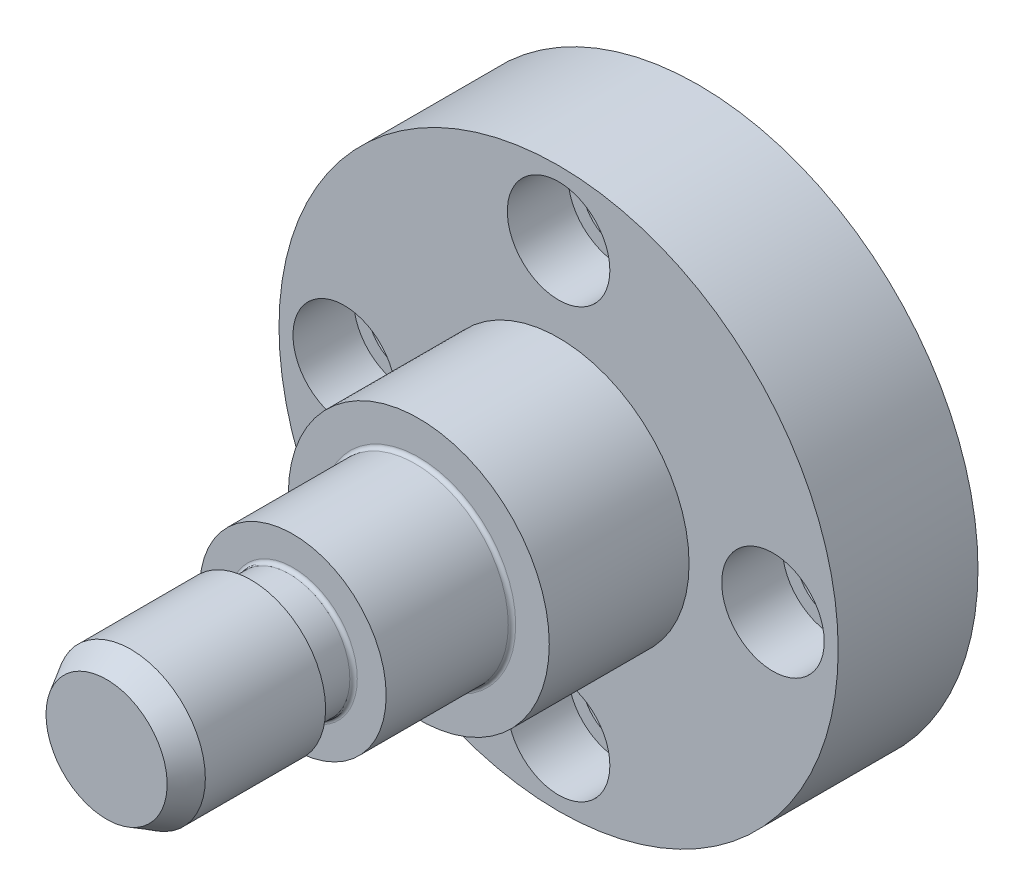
ISO-10303-21;
HEADER;
FILE_DESCRIPTION(('STEP AP214'),'2;1');
FILE_NAME('part.step','',(''),(''),'','','');
FILE_SCHEMA(('AUTOMOTIVE_DESIGN { 1 0 10303 214 1 1 1 1 }'));
ENDSEC;
DATA;
#1=APPLICATION_CONTEXT('core data for automotive mechanical design processes');
#2=APPLICATION_PROTOCOL_DEFINITION('international standard','automotive_design',2000,#1);
#3=PRODUCT_CONTEXT('',#1,'mechanical');
#4=PRODUCT('Part','Part','',(#3));
#5=PRODUCT_RELATED_PRODUCT_CATEGORY('part','',(#4));
#6=PRODUCT_DEFINITION_FORMATION('','',#4);
#7=PRODUCT_DEFINITION_CONTEXT('part definition',#1,'design');
#8=PRODUCT_DEFINITION('design','',#6,#7);
#9=PRODUCT_DEFINITION_SHAPE('','',#8);
#10=(LENGTH_UNIT() NAMED_UNIT(*) SI_UNIT(.MILLI.,.METRE.));
#11=(NAMED_UNIT(*) PLANE_ANGLE_UNIT() SI_UNIT($,.RADIAN.));
#12=(NAMED_UNIT(*) SI_UNIT($,.STERADIAN.) SOLID_ANGLE_UNIT());
#13=UNCERTAINTY_MEASURE_WITH_UNIT(LENGTH_MEASURE(1.E-05),#10,'distance_accuracy_value','');
#14=(GEOMETRIC_REPRESENTATION_CONTEXT(3) GLOBAL_UNCERTAINTY_ASSIGNED_CONTEXT((#13)) GLOBAL_UNIT_ASSIGNED_CONTEXT((#10,
#11,#12)) REPRESENTATION_CONTEXT('',''));
#15=CARTESIAN_POINT('',(0.,0.,0.));
#16=DIRECTION('',(0.,0.,1.));
#17=DIRECTION('',(1.,0.,0.));
#18=AXIS2_PLACEMENT_3D('',#15,#16,#17);
#19=CARTESIAN_POINT('',(-6.578,-6.600634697,63.5));
#20=DIRECTION('',(0.,0.,1.));
#21=DIRECTION('',(1.,0.,0.));
#22=AXIS2_PLACEMENT_3D('',#19,#20,#21);
#23=PLANE('',#22);
#24=CARTESIAN_POINT('',(0.,0.,63.5));
#25=DIRECTION('',(0.,0.,-1.));
#26=DIRECTION('',(-1.,0.,0.));
#27=AXIS2_PLACEMENT_3D('',#24,#25,#26);
#28=CIRCLE('',#27,6.5);
#29=CARTESIAN_POINT('',(-6.5,0.,63.5));
#30=VERTEX_POINT('',#29);
#31=EDGE_CURVE('E16',#30,#30,#28,.T.);
#32=ORIENTED_EDGE('',*,*,#31,.F.);
#33=EDGE_LOOP('',(#32));
#34=FACE_BOUND('',#33,.T.);
#35=ADVANCED_FACE('F12',(#34),#23,.T.);
#36=CARTESIAN_POINT('',(0.,0.,63.5));
#37=DIRECTION('',(0.,0.,-1.));
#38=DIRECTION('',(-1.,0.,0.));
#39=AXIS2_PLACEMENT_3D('',#36,#37,#38);
#40=CONICAL_SURFACE('',#39,6.5,0.523598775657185);
#41=ORIENTED_EDGE('',*,*,#31,.T.);
#42=EDGE_LOOP('',(#41));
#43=FACE_BOUND('',#42,.T.);
#44=CARTESIAN_POINT('',(0.,0.,60.901923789));
#45=DIRECTION('',(0.,0.,1.));
#46=DIRECTION('',(1.,0.,0.));
#47=AXIS2_PLACEMENT_3D('',#44,#45,#46);
#48=CIRCLE('',#47,8.);
#49=CARTESIAN_POINT('',(8.,0.,60.901923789));
#50=VERTEX_POINT('',#49);
#51=EDGE_CURVE('E28',#50,#50,#48,.F.);
#52=ORIENTED_EDGE('',*,*,#51,.F.);
#53=EDGE_LOOP('',(#52));
#54=FACE_BOUND('',#53,.T.);
#55=ADVANCED_FACE('F107',(#43,#54),#40,.T.);
#56=CARTESIAN_POINT('',(0.,0.,48.));
#57=DIRECTION('',(0.,0.,1.));
#58=DIRECTION('',(1.,0.,0.));
#59=AXIS2_PLACEMENT_3D('',#56,#57,#58);
#60=CYLINDRICAL_SURFACE('',#59,8.);
#61=CARTESIAN_POINT('',(0.,0.,48.));
#62=DIRECTION('',(0.,0.,1.));
#63=DIRECTION('',(1.,0.,0.));
#64=AXIS2_PLACEMENT_3D('',#61,#62,#63);
#65=CIRCLE('',#64,8.);
#66=CARTESIAN_POINT('',(8.,0.,48.));
#67=VERTEX_POINT('',#66);
#68=EDGE_CURVE('E97',#67,#67,#65,.F.);
#69=ORIENTED_EDGE('',*,*,#68,.F.);
#70=EDGE_LOOP('',(#69));
#71=FACE_BOUND('',#70,.T.);
#72=ORIENTED_EDGE('',*,*,#51,.T.);
#73=EDGE_LOOP('',(#72));
#74=FACE_BOUND('',#73,.T.);
#75=ADVANCED_FACE('F117',(#71,#74),#60,.T.);
#76=CARTESIAN_POINT('',(8.096,-8.123858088,48.));
#77=DIRECTION('',(0.,0.,-1.));
#78=DIRECTION('',(-1.,0.,0.));
#79=AXIS2_PLACEMENT_3D('',#76,#77,#78);
#80=PLANE('',#79);
#81=CARTESIAN_POINT('',(0.,0.,48.));
#82=DIRECTION('',(0.,0.,1.));
#83=DIRECTION('',(0.,-1.,0.));
#84=AXIS2_PLACEMENT_3D('',#81,#82,#83);
#85=CIRCLE('',#84,6.5);
#86=CARTESIAN_POINT('',(0.,-6.5,48.));
#87=VERTEX_POINT('',#86);
#88=EDGE_CURVE('E95',#87,#87,#85,.F.);
#89=ORIENTED_EDGE('',*,*,#88,.F.);
#90=EDGE_LOOP('',(#89));
#91=FACE_BOUND('',#90,.T.);
#92=ORIENTED_EDGE('',*,*,#68,.T.);
#93=EDGE_LOOP('',(#92));
#94=FACE_BOUND('',#93,.T.);
#95=ADVANCED_FACE('F182',(#91,#94),#80,.T.);
#96=CARTESIAN_POINT('',(0.,0.,43.9));
#97=DIRECTION('',(0.,0.,1.));
#98=DIRECTION('',(0.,-1.,0.));
#99=AXIS2_PLACEMENT_3D('',#96,#97,#98);
#100=CYLINDRICAL_SURFACE('',#99,6.5);
#101=CARTESIAN_POINT('',(0.,0.,43.9));
#102=DIRECTION('',(0.,0.,1.));
#103=DIRECTION('',(1.,0.,0.));
#104=AXIS2_PLACEMENT_3D('',#101,#102,#103);
#105=CIRCLE('',#104,6.5);
#106=CARTESIAN_POINT('',(6.5,0.,43.9));
#107=VERTEX_POINT('',#106);
#108=EDGE_CURVE('E94',#107,#107,#105,.T.);
#109=ORIENTED_EDGE('',*,*,#108,.T.);
#110=EDGE_LOOP('',(#109));
#111=FACE_BOUND('',#110,.T.);
#112=ORIENTED_EDGE('',*,*,#88,.T.);
#113=EDGE_LOOP('',(#112));
#114=FACE_BOUND('',#113,.T.);
#115=ADVANCED_FACE('F178',(#111,#114),#100,.T.);
#116=CARTESIAN_POINT('',(0.,0.,43.9));
#117=DIRECTION('',(0.,0.,1.));
#118=DIRECTION('',(1.,0.,0.));
#119=AXIS2_PLACEMENT_3D('',#116,#117,#118);
#120=TOROIDAL_SURFACE('',#119,6.9,0.4);
#121=CARTESIAN_POINT('',(0.,0.,43.5));
#122=DIRECTION('',(0.,0.,1.));
#123=DIRECTION('',(1.,0.,0.));
#124=AXIS2_PLACEMENT_3D('',#121,#122,#123);
#125=CIRCLE('',#124,6.90000000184);
#126=CARTESIAN_POINT('',(6.90000000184,0.,43.5));
#127=VERTEX_POINT('',#126);
#128=EDGE_CURVE('E91',#127,#127,#125,.F.);
#129=ORIENTED_EDGE('',*,*,#128,.F.);
#130=EDGE_LOOP('',(#129));
#131=FACE_BOUND('',#130,.T.);
#132=ORIENTED_EDGE('',*,*,#108,.F.);
#133=EDGE_LOOP('',(#132));
#134=FACE_BOUND('',#133,.T.);
#135=ADVANCED_FACE('F181',(#131,#134),#120,.F.);
#136=CARTESIAN_POINT('',(-10.12,-10.15482261,43.5));
#137=DIRECTION('',(0.,0.,1.));
#138=DIRECTION('',(1.,0.,0.));
#139=AXIS2_PLACEMENT_3D('',#136,#137,#138);
#140=PLANE('',#139);
#141=ORIENTED_EDGE('',*,*,#128,.T.);
#142=EDGE_LOOP('',(#141));
#143=FACE_BOUND('',#142,.T.);
#144=CARTESIAN_POINT('',(0.,0.,43.5));
#145=DIRECTION('',(0.,0.,1.));
#146=DIRECTION('',(1.,0.,0.));
#147=AXIS2_PLACEMENT_3D('',#144,#145,#146);
#148=CIRCLE('',#147,10.);
#149=CARTESIAN_POINT('',(10.,0.,43.5));
#150=VERTEX_POINT('',#149);
#151=EDGE_CURVE('E88',#150,#150,#148,.F.);
#152=ORIENTED_EDGE('',*,*,#151,.F.);
#153=EDGE_LOOP('',(#152));
#154=FACE_BOUND('',#153,.T.);
#155=ADVANCED_FACE('F176',(#143,#154),#140,.T.);
#156=CARTESIAN_POINT('',(0.,0.,30.4));
#157=DIRECTION('',(0.,0.,1.));
#158=DIRECTION('',(1.,0.,0.));
#159=AXIS2_PLACEMENT_3D('',#156,#157,#158);
#160=CYLINDRICAL_SURFACE('',#159,10.);
#161=CARTESIAN_POINT('',(0.,0.,30.4));
#162=DIRECTION('',(0.,0.,1.));
#163=DIRECTION('',(1.,0.,0.));
#164=AXIS2_PLACEMENT_3D('',#161,#162,#163);
#165=CIRCLE('',#164,10.);
#166=CARTESIAN_POINT('',(10.,0.,30.4));
#167=VERTEX_POINT('',#166);
#168=EDGE_CURVE('E87',#167,#167,#165,.T.);
#169=ORIENTED_EDGE('',*,*,#168,.T.);
#170=EDGE_LOOP('',(#169));
#171=FACE_BOUND('',#170,.T.);
#172=ORIENTED_EDGE('',*,*,#151,.T.);
#173=EDGE_LOOP('',(#172));
#174=FACE_BOUND('',#173,.T.);
#175=ADVANCED_FACE('F172',(#171,#174),#160,.T.);
#176=CARTESIAN_POINT('',(0.,0.,30.4));
#177=DIRECTION('',(0.,0.,1.));
#178=DIRECTION('',(1.,0.,0.));
#179=AXIS2_PLACEMENT_3D('',#176,#177,#178);
#180=TOROIDAL_SURFACE('',#179,10.4,0.400000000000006);
#181=CARTESIAN_POINT('',(0.,0.,30.));
#182=DIRECTION('',(0.,0.,1.));
#183=DIRECTION('',(1.,0.,0.));
#184=AXIS2_PLACEMENT_3D('',#181,#182,#183);
#185=CIRCLE('',#184,10.39999999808);
#186=CARTESIAN_POINT('',(10.39999999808,0.,30.));
#187=VERTEX_POINT('',#186);
#188=EDGE_CURVE('E84',#187,#187,#185,.F.);
#189=ORIENTED_EDGE('',*,*,#188,.F.);
#190=EDGE_LOOP('',(#189));
#191=FACE_BOUND('',#190,.T.);
#192=ORIENTED_EDGE('',*,*,#168,.F.);
#193=EDGE_LOOP('',(#192));
#194=FACE_BOUND('',#193,.T.);
#195=ADVANCED_FACE('F175',(#191,#194),#180,.F.);
#196=CARTESIAN_POINT('',(-14.168,-14.216751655,30.));
#197=DIRECTION('',(0.,0.,1.));
#198=DIRECTION('',(1.,0.,0.));
#199=AXIS2_PLACEMENT_3D('',#196,#197,#198);
#200=PLANE('',#199);
#201=ORIENTED_EDGE('',*,*,#188,.T.);
#202=EDGE_LOOP('',(#201));
#203=FACE_BOUND('',#202,.T.);
#204=CARTESIAN_POINT('',(0.,0.,30.));
#205=DIRECTION('',(0.,0.,1.));
#206=DIRECTION('',(1.,0.,0.));
#207=AXIS2_PLACEMENT_3D('',#204,#205,#206);
#208=CIRCLE('',#207,14.);
#209=CARTESIAN_POINT('',(14.,0.,30.));
#210=VERTEX_POINT('',#209);
#211=EDGE_CURVE('E81',#210,#210,#208,.F.);
#212=ORIENTED_EDGE('',*,*,#211,.F.);
#213=EDGE_LOOP('',(#212));
#214=FACE_BOUND('',#213,.T.);
#215=ADVANCED_FACE('F170',(#203,#214),#200,.T.);
#216=CARTESIAN_POINT('',(0.,0.,15.));
#217=DIRECTION('',(0.,0.,1.));
#218=DIRECTION('',(1.,0.,0.));
#219=AXIS2_PLACEMENT_3D('',#216,#217,#218);
#220=CYLINDRICAL_SURFACE('',#219,14.);
#221=CARTESIAN_POINT('',(0.,0.,15.));
#222=DIRECTION('',(0.,0.,1.));
#223=DIRECTION('',(1.,0.,0.));
#224=AXIS2_PLACEMENT_3D('',#221,#222,#223);
#225=CIRCLE('',#224,14.);
#226=CARTESIAN_POINT('',(14.,0.,15.));
#227=VERTEX_POINT('',#226);
#228=EDGE_CURVE('E69',#227,#227,#225,.F.);
#229=ORIENTED_EDGE('',*,*,#228,.F.);
#230=EDGE_LOOP('',(#229));
#231=FACE_BOUND('',#230,.T.);
#232=ORIENTED_EDGE('',*,*,#211,.T.);
#233=EDGE_LOOP('',(#232));
#234=FACE_BOUND('',#233,.T.);
#235=ADVANCED_FACE('F166',(#231,#234),#220,.T.);
#236=CARTESIAN_POINT('',(0.,-23.,8.5));
#237=DIRECTION('',(0.,0.,1.));
#238=DIRECTION('',(1.,0.,0.));
#239=AXIS2_PLACEMENT_3D('',#236,#237,#238);
#240=CYLINDRICAL_SURFACE('',#239,5.5);
#241=CARTESIAN_POINT('',(0.,-23.,8.5));
#242=DIRECTION('',(0.,0.,1.));
#243=DIRECTION('',(1.,0.,0.));
#244=AXIS2_PLACEMENT_3D('',#241,#242,#243);
#245=CIRCLE('',#244,5.5);
#246=CARTESIAN_POINT('',(5.5,-23.,8.5));
#247=VERTEX_POINT('',#246);
#248=EDGE_CURVE('E66',#247,#247,#245,.F.);
#249=ORIENTED_EDGE('',*,*,#248,.T.);
#250=EDGE_LOOP('',(#249));
#251=FACE_BOUND('',#250,.T.);
#252=CARTESIAN_POINT('',(0.,-23.,15.));
#253=DIRECTION('',(0.,0.,1.));
#254=DIRECTION('',(1.,0.,0.));
#255=AXIS2_PLACEMENT_3D('',#252,#253,#254);
#256=CIRCLE('',#255,5.5);
#257=CARTESIAN_POINT('',(5.5,-23.,15.));
#258=VERTEX_POINT('',#257);
#259=EDGE_CURVE('E78',#258,#258,#256,.F.);
#260=ORIENTED_EDGE('',*,*,#259,.F.);
#261=EDGE_LOOP('',(#260));
#262=FACE_BOUND('',#261,.T.);
#263=ADVANCED_FACE('F162',(#251,#262),#240,.F.);
#264=CARTESIAN_POINT('',(-23.,0.,8.5));
#265=DIRECTION('',(0.,0.,1.));
#266=DIRECTION('',(1.,0.,0.));
#267=AXIS2_PLACEMENT_3D('',#264,#265,#266);
#268=CYLINDRICAL_SURFACE('',#267,5.5);
#269=CARTESIAN_POINT('',(-23.,0.,8.5));
#270=DIRECTION('',(0.,0.,1.));
#271=DIRECTION('',(1.,0.,0.));
#272=AXIS2_PLACEMENT_3D('',#269,#270,#271);
#273=CIRCLE('',#272,5.5);
#274=CARTESIAN_POINT('',(-17.5,0.,8.5));
#275=VERTEX_POINT('',#274);
#276=EDGE_CURVE('E63',#275,#275,#273,.F.);
#277=ORIENTED_EDGE('',*,*,#276,.T.);
#278=EDGE_LOOP('',(#277));
#279=FACE_BOUND('',#278,.T.);
#280=CARTESIAN_POINT('',(-23.,0.,15.));
#281=DIRECTION('',(0.,0.,1.));
#282=DIRECTION('',(1.,0.,0.));
#283=AXIS2_PLACEMENT_3D('',#280,#281,#282);
#284=CIRCLE('',#283,5.5);
#285=CARTESIAN_POINT('',(-17.5,0.,15.));
#286=VERTEX_POINT('',#285);
#287=EDGE_CURVE('E75',#286,#286,#284,.F.);
#288=ORIENTED_EDGE('',*,*,#287,.F.);
#289=EDGE_LOOP('',(#288));
#290=FACE_BOUND('',#289,.T.);
#291=ADVANCED_FACE('F158',(#279,#290),#268,.F.);
#292=CARTESIAN_POINT('',(0.,23.,8.5));
#293=DIRECTION('',(0.,0.,1.));
#294=DIRECTION('',(1.,0.,0.));
#295=AXIS2_PLACEMENT_3D('',#292,#293,#294);
#296=CYLINDRICAL_SURFACE('',#295,5.5);
#297=CARTESIAN_POINT('',(0.,23.,8.5));
#298=DIRECTION('',(0.,0.,1.));
#299=DIRECTION('',(1.,0.,0.));
#300=AXIS2_PLACEMENT_3D('',#297,#298,#299);
#301=CIRCLE('',#300,5.5);
#302=CARTESIAN_POINT('',(5.5,23.,8.5));
#303=VERTEX_POINT('',#302);
#304=EDGE_CURVE('E60',#303,#303,#301,.F.);
#305=ORIENTED_EDGE('',*,*,#304,.T.);
#306=EDGE_LOOP('',(#305));
#307=FACE_BOUND('',#306,.T.);
#308=CARTESIAN_POINT('',(0.,23.,15.));
#309=DIRECTION('',(0.,0.,1.));
#310=DIRECTION('',(1.,0.,0.));
#311=AXIS2_PLACEMENT_3D('',#308,#309,#310);
#312=CIRCLE('',#311,5.5);
#313=CARTESIAN_POINT('',(5.5,23.,15.));
#314=VERTEX_POINT('',#313);
#315=EDGE_CURVE('E72',#314,#314,#312,.F.);
#316=ORIENTED_EDGE('',*,*,#315,.F.);
#317=EDGE_LOOP('',(#316));
#318=FACE_BOUND('',#317,.T.);
#319=ADVANCED_FACE('F154',(#307,#318),#296,.F.);
#320=CARTESIAN_POINT('',(-30.36,-30.464467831,15.));
#321=DIRECTION('',(0.,0.,1.));
#322=DIRECTION('',(1.,0.,0.));
#323=AXIS2_PLACEMENT_3D('',#320,#321,#322);
#324=PLANE('',#323);
#325=ORIENTED_EDGE('',*,*,#228,.T.);
#326=EDGE_LOOP('',(#325));
#327=FACE_BOUND('',#326,.T.);
#328=ORIENTED_EDGE('',*,*,#315,.T.);
#329=EDGE_LOOP('',(#328));
#330=FACE_BOUND('',#329,.T.);
#331=ORIENTED_EDGE('',*,*,#287,.T.);
#332=EDGE_LOOP('',(#331));
#333=FACE_BOUND('',#332,.T.);
#334=ORIENTED_EDGE('',*,*,#259,.T.);
#335=EDGE_LOOP('',(#334));
#336=FACE_BOUND('',#335,.T.);
#337=CARTESIAN_POINT('',(23.,0.,15.));
#338=DIRECTION('',(0.,0.,1.));
#339=DIRECTION('',(1.,0.,0.));
#340=AXIS2_PLACEMENT_3D('',#337,#338,#339);
#341=CIRCLE('',#340,5.5);
#342=CARTESIAN_POINT('',(28.5,0.,15.));
#343=VERTEX_POINT('',#342);
#344=EDGE_CURVE('E57',#343,#343,#341,.F.);
#345=ORIENTED_EDGE('',*,*,#344,.T.);
#346=EDGE_LOOP('',(#345));
#347=FACE_BOUND('',#346,.T.);
#348=CARTESIAN_POINT('',(0.,0.,15.));
#349=DIRECTION('',(0.,0.,1.));
#350=DIRECTION('',(1.,0.,0.));
#351=AXIS2_PLACEMENT_3D('',#348,#349,#350);
#352=CIRCLE('',#351,30.);
#353=CARTESIAN_POINT('',(30.,0.,15.));
#354=VERTEX_POINT('',#353);
#355=EDGE_CURVE('E54',#354,#354,#352,.F.);
#356=ORIENTED_EDGE('',*,*,#355,.F.);
#357=EDGE_LOOP('',(#356));
#358=FACE_BOUND('',#357,.T.);
#359=ADVANCED_FACE('F157',(#327,#330,#333,#336,#347,#358),#324,.T.);
#360=CARTESIAN_POINT('',(-5.566,-17.414847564,8.5));
#361=DIRECTION('',(0.,0.,-1.));
#362=DIRECTION('',(1.,0.,0.));
#363=AXIS2_PLACEMENT_3D('',#360,#361,#362);
#364=PLANE('',#363);
#365=CARTESIAN_POINT('',(0.,-23.,8.5));
#366=DIRECTION('',(0.,0.,1.));
#367=DIRECTION('',(1.,0.,0.));
#368=AXIS2_PLACEMENT_3D('',#365,#366,#367);
#369=CIRCLE('',#368,4.);
#370=CARTESIAN_POINT('',(4.,-23.,8.5));
#371=VERTEX_POINT('',#370);
#372=EDGE_CURVE('E51',#371,#371,#369,.F.);
#373=ORIENTED_EDGE('',*,*,#372,.T.);
#374=EDGE_LOOP('',(#373));
#375=FACE_BOUND('',#374,.T.);
#376=ORIENTED_EDGE('',*,*,#248,.F.);
#377=EDGE_LOOP('',(#376));
#378=FACE_BOUND('',#377,.T.);
#379=ADVANCED_FACE('F210',(#375,#378),#364,.F.);
#380=CARTESIAN_POINT('',(-17.414847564,5.566,8.5));
#381=DIRECTION('',(0.,0.,-1.));
#382=DIRECTION('',(0.,-1.,0.));
#383=AXIS2_PLACEMENT_3D('',#380,#381,#382);
#384=PLANE('',#383);
#385=CARTESIAN_POINT('',(-23.,0.,8.5));
#386=DIRECTION('',(0.,0.,1.));
#387=DIRECTION('',(1.,0.,0.));
#388=AXIS2_PLACEMENT_3D('',#385,#386,#387);
#389=CIRCLE('',#388,4.);
#390=CARTESIAN_POINT('',(-19.,0.,8.5));
#391=VERTEX_POINT('',#390);
#392=EDGE_CURVE('E48',#391,#391,#389,.F.);
#393=ORIENTED_EDGE('',*,*,#392,.T.);
#394=EDGE_LOOP('',(#393));
#395=FACE_BOUND('',#394,.T.);
#396=ORIENTED_EDGE('',*,*,#276,.F.);
#397=EDGE_LOOP('',(#396));
#398=FACE_BOUND('',#397,.T.);
#399=ADVANCED_FACE('F214',(#395,#398),#384,.F.);
#400=CARTESIAN_POINT('',(5.566,17.414847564,8.5));
#401=DIRECTION('',(0.,0.,-1.));
#402=DIRECTION('',(-1.,0.,0.));
#403=AXIS2_PLACEMENT_3D('',#400,#401,#402);
#404=PLANE('',#403);
#405=CARTESIAN_POINT('',(0.,23.,8.5));
#406=DIRECTION('',(0.,0.,1.));
#407=DIRECTION('',(1.,0.,0.));
#408=AXIS2_PLACEMENT_3D('',#405,#406,#407);
#409=CIRCLE('',#408,4.);
#410=CARTESIAN_POINT('',(4.,23.,8.5));
#411=VERTEX_POINT('',#410);
#412=EDGE_CURVE('E45',#411,#411,#409,.F.);
#413=ORIENTED_EDGE('',*,*,#412,.T.);
#414=EDGE_LOOP('',(#413));
#415=FACE_BOUND('',#414,.T.);
#416=ORIENTED_EDGE('',*,*,#304,.F.);
#417=EDGE_LOOP('',(#416));
#418=FACE_BOUND('',#417,.T.);
#419=ADVANCED_FACE('F152',(#415,#418),#404,.F.);
#420=CARTESIAN_POINT('',(23.,0.,8.5));
#421=DIRECTION('',(0.,0.,1.));
#422=DIRECTION('',(1.,0.,0.));
#423=AXIS2_PLACEMENT_3D('',#420,#421,#422);
#424=CYLINDRICAL_SURFACE('',#423,5.5);
#425=CARTESIAN_POINT('',(23.,0.,8.5));
#426=DIRECTION('',(0.,0.,1.));
#427=DIRECTION('',(1.,0.,0.));
#428=AXIS2_PLACEMENT_3D('',#425,#426,#427);
#429=CIRCLE('',#428,5.5);
#430=CARTESIAN_POINT('',(28.5,0.,8.5));
#431=VERTEX_POINT('',#430);
#432=EDGE_CURVE('E42',#431,#431,#429,.F.);
#433=ORIENTED_EDGE('',*,*,#432,.T.);
#434=EDGE_LOOP('',(#433));
#435=FACE_BOUND('',#434,.T.);
#436=ORIENTED_EDGE('',*,*,#344,.F.);
#437=EDGE_LOOP('',(#436));
#438=FACE_BOUND('',#437,.T.);
#439=ADVANCED_FACE('F148',(#435,#438),#424,.F.);
#440=CARTESIAN_POINT('',(0.,0.,0.));
#441=DIRECTION('',(0.,0.,1.));
#442=DIRECTION('',(1.,0.,0.));
#443=AXIS2_PLACEMENT_3D('',#440,#441,#442);
#444=CYLINDRICAL_SURFACE('',#443,30.);
#445=CARTESIAN_POINT('',(0.,0.,0.));
#446=DIRECTION('',(0.,0.,1.));
#447=DIRECTION('',(1.,0.,0.));
#448=AXIS2_PLACEMENT_3D('',#445,#446,#447);
#449=CIRCLE('',#448,30.);
#450=CARTESIAN_POINT('',(30.,0.,0.));
#451=VERTEX_POINT('',#450);
#452=EDGE_CURVE('E39',#451,#451,#449,.F.);
#453=ORIENTED_EDGE('',*,*,#452,.F.);
#454=EDGE_LOOP('',(#453));
#455=FACE_BOUND('',#454,.T.);
#456=ORIENTED_EDGE('',*,*,#355,.T.);
#457=EDGE_LOOP('',(#456));
#458=FACE_BOUND('',#457,.T.);
#459=ADVANCED_FACE('F144',(#455,#458),#444,.T.);
#460=CARTESIAN_POINT('',(0.,-23.,0.));
#461=DIRECTION('',(0.,0.,1.));
#462=DIRECTION('',(1.,0.,0.));
#463=AXIS2_PLACEMENT_3D('',#460,#461,#462);
#464=CYLINDRICAL_SURFACE('',#463,4.);
#465=ORIENTED_EDGE('',*,*,#372,.F.);
#466=EDGE_LOOP('',(#465));
#467=FACE_BOUND('',#466,.T.);
#468=CARTESIAN_POINT('',(0.,-23.,0.));
#469=DIRECTION('',(0.,0.,1.));
#470=DIRECTION('',(1.,0.,0.));
#471=AXIS2_PLACEMENT_3D('',#468,#469,#470);
#472=CIRCLE('',#471,4.);
#473=CARTESIAN_POINT('',(4.,-23.,0.));
#474=VERTEX_POINT('',#473);
#475=EDGE_CURVE('E36',#474,#474,#472,.T.);
#476=ORIENTED_EDGE('',*,*,#475,.F.);
#477=EDGE_LOOP('',(#476));
#478=FACE_BOUND('',#477,.T.);
#479=ADVANCED_FACE('F140',(#467,#478),#464,.F.);
#480=CARTESIAN_POINT('',(-23.,0.,0.));
#481=DIRECTION('',(0.,0.,1.));
#482=DIRECTION('',(1.,0.,0.));
#483=AXIS2_PLACEMENT_3D('',#480,#481,#482);
#484=CYLINDRICAL_SURFACE('',#483,4.);
#485=ORIENTED_EDGE('',*,*,#392,.F.);
#486=EDGE_LOOP('',(#485));
#487=FACE_BOUND('',#486,.T.);
#488=CARTESIAN_POINT('',(-23.,0.,0.));
#489=DIRECTION('',(0.,0.,1.));
#490=DIRECTION('',(1.,0.,0.));
#491=AXIS2_PLACEMENT_3D('',#488,#489,#490);
#492=CIRCLE('',#491,4.);
#493=CARTESIAN_POINT('',(-19.,0.,0.));
#494=VERTEX_POINT('',#493);
#495=EDGE_CURVE('E33',#494,#494,#492,.T.);
#496=ORIENTED_EDGE('',*,*,#495,.F.);
#497=EDGE_LOOP('',(#496));
#498=FACE_BOUND('',#497,.T.);
#499=ADVANCED_FACE('F136',(#487,#498),#484,.F.);
#500=CARTESIAN_POINT('',(0.,23.,0.));
#501=DIRECTION('',(0.,0.,1.));
#502=DIRECTION('',(1.,0.,0.));
#503=AXIS2_PLACEMENT_3D('',#500,#501,#502);
#504=CYLINDRICAL_SURFACE('',#503,4.);
#505=ORIENTED_EDGE('',*,*,#412,.F.);
#506=EDGE_LOOP('',(#505));
#507=FACE_BOUND('',#506,.T.);
#508=CARTESIAN_POINT('',(0.,23.,0.));
#509=DIRECTION('',(0.,0.,1.));
#510=DIRECTION('',(1.,0.,0.));
#511=AXIS2_PLACEMENT_3D('',#508,#509,#510);
#512=CIRCLE('',#511,4.);
#513=CARTESIAN_POINT('',(4.,23.,0.));
#514=VERTEX_POINT('',#513);
#515=EDGE_CURVE('E25',#514,#514,#512,.T.);
#516=ORIENTED_EDGE('',*,*,#515,.F.);
#517=EDGE_LOOP('',(#516));
#518=FACE_BOUND('',#517,.T.);
#519=ADVANCED_FACE('F133',(#507,#518),#504,.F.);
#520=CARTESIAN_POINT('',(17.414847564,-5.566,8.5));
#521=DIRECTION('',(0.,0.,-1.));
#522=DIRECTION('',(0.,1.,0.));
#523=AXIS2_PLACEMENT_3D('',#520,#521,#522);
#524=PLANE('',#523);
#525=CARTESIAN_POINT('',(23.,0.,8.5));
#526=DIRECTION('',(0.,0.,1.));
#527=DIRECTION('',(1.,0.,0.));
#528=AXIS2_PLACEMENT_3D('',#525,#526,#527);
#529=CIRCLE('',#528,4.);
#530=CARTESIAN_POINT('',(27.,0.,8.5));
#531=VERTEX_POINT('',#530);
#532=EDGE_CURVE('E20',#531,#531,#529,.F.);
#533=ORIENTED_EDGE('',*,*,#532,.T.);
#534=EDGE_LOOP('',(#533));
#535=FACE_BOUND('',#534,.T.);
#536=ORIENTED_EDGE('',*,*,#432,.F.);
#537=EDGE_LOOP('',(#536));
#538=FACE_BOUND('',#537,.T.);
#539=ADVANCED_FACE('F128',(#535,#538),#524,.F.);
#540=CARTESIAN_POINT('',(30.36,-30.464467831,0.));
#541=DIRECTION('',(0.,0.,-1.));
#542=DIRECTION('',(-1.,0.,0.));
#543=AXIS2_PLACEMENT_3D('',#540,#541,#542);
#544=PLANE('',#543);
#545=ORIENTED_EDGE('',*,*,#515,.T.);
#546=EDGE_LOOP('',(#545));
#547=FACE_BOUND('',#546,.T.);
#548=ORIENTED_EDGE('',*,*,#495,.T.);
#549=EDGE_LOOP('',(#548));
#550=FACE_BOUND('',#549,.T.);
#551=ORIENTED_EDGE('',*,*,#475,.T.);
#552=EDGE_LOOP('',(#551));
#553=FACE_BOUND('',#552,.T.);
#554=CARTESIAN_POINT('',(23.,0.,0.));
#555=DIRECTION('',(0.,0.,1.));
#556=DIRECTION('',(1.,0.,0.));
#557=AXIS2_PLACEMENT_3D('',#554,#555,#556);
#558=CIRCLE('',#557,4.);
#559=CARTESIAN_POINT('',(27.,0.,0.));
#560=VERTEX_POINT('',#559);
#561=EDGE_CURVE('E8',#560,#560,#558,.T.);
#562=ORIENTED_EDGE('',*,*,#561,.T.);
#563=EDGE_LOOP('',(#562));
#564=FACE_BOUND('',#563,.T.);
#565=ORIENTED_EDGE('',*,*,#452,.T.);
#566=EDGE_LOOP('',(#565));
#567=FACE_BOUND('',#566,.T.);
#568=ADVANCED_FACE('F14',(#547,#550,#553,#564,#567),#544,.T.);
#569=CARTESIAN_POINT('',(23.,0.,0.));
#570=DIRECTION('',(0.,0.,1.));
#571=DIRECTION('',(1.,0.,0.));
#572=AXIS2_PLACEMENT_3D('',#569,#570,#571);
#573=CYLINDRICAL_SURFACE('',#572,4.);
#574=ORIENTED_EDGE('',*,*,#532,.F.);
#575=EDGE_LOOP('',(#574));
#576=FACE_BOUND('',#575,.T.);
#577=ORIENTED_EDGE('',*,*,#561,.F.);
#578=EDGE_LOOP('',(#577));
#579=FACE_BOUND('',#578,.T.);
#580=ADVANCED_FACE('F121',(#576,#579),#573,.F.);
#581=CLOSED_SHELL('',(#35,#55,#75,#95,#115,#135,#155,#175,#195,#215,#235,#263,#291,#319,#359,
#379,#399,#419,#439,#459,#479,#499,#519,#539,#568,#580));
#582=MANIFOLD_SOLID_BREP('B1',#581);
#583=ADVANCED_BREP_SHAPE_REPRESENTATION('',(#18,#582),#14);
#584=SHAPE_DEFINITION_REPRESENTATION(#9,#583);
ENDSEC;
END-ISO-10303-21;
